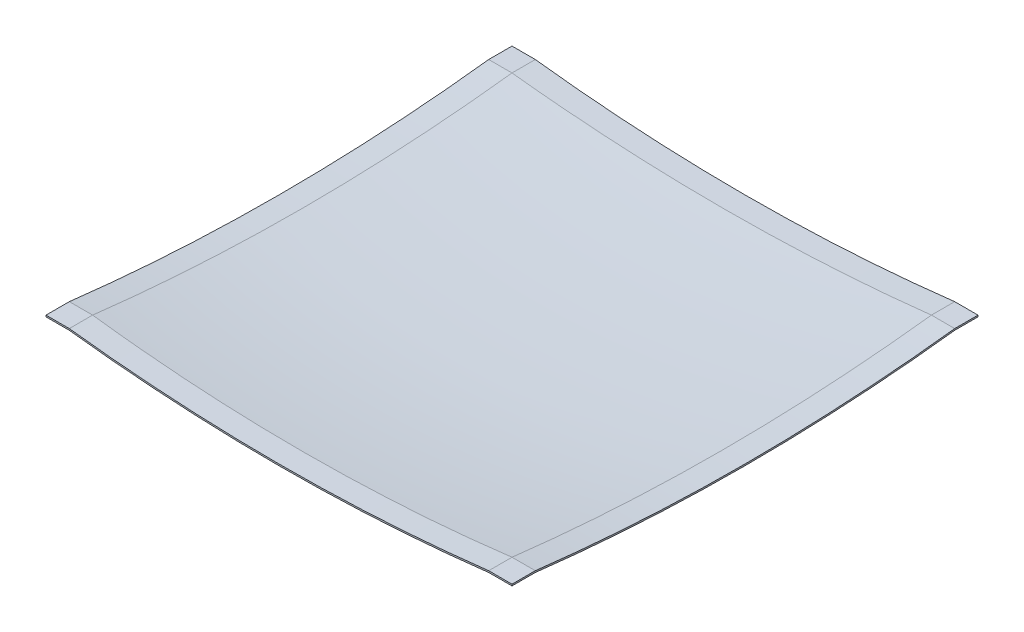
ISO-10303-21;
HEADER;
FILE_DESCRIPTION(('STEP AP214'),'2;1');
FILE_NAME('part.step','',(''),(''),'','','');
FILE_SCHEMA(('AUTOMOTIVE_DESIGN { 1 0 10303 214 1 1 1 1 }'));
ENDSEC;
DATA;
#1=APPLICATION_CONTEXT('core data for automotive mechanical design processes');
#2=APPLICATION_PROTOCOL_DEFINITION('international standard','automotive_design',2000,#1);
#3=PRODUCT_CONTEXT('',#1,'mechanical');
#4=PRODUCT('Part','Part','',(#3));
#5=PRODUCT_RELATED_PRODUCT_CATEGORY('part','',(#4));
#6=PRODUCT_DEFINITION_FORMATION('','',#4);
#7=PRODUCT_DEFINITION_CONTEXT('part definition',#1,'design');
#8=PRODUCT_DEFINITION('design','',#6,#7);
#9=PRODUCT_DEFINITION_SHAPE('','',#8);
#10=(LENGTH_UNIT() NAMED_UNIT(*) SI_UNIT(.MILLI.,.METRE.));
#11=(NAMED_UNIT(*) PLANE_ANGLE_UNIT() SI_UNIT($,.RADIAN.));
#12=(NAMED_UNIT(*) SI_UNIT($,.STERADIAN.) SOLID_ANGLE_UNIT());
#13=UNCERTAINTY_MEASURE_WITH_UNIT(LENGTH_MEASURE(1.E-05),#10,'distance_accuracy_value','');
#14=(GEOMETRIC_REPRESENTATION_CONTEXT(3) GLOBAL_UNCERTAINTY_ASSIGNED_CONTEXT((#13)) GLOBAL_UNIT_ASSIGNED_CONTEXT((#10,
#11,#12)) REPRESENTATION_CONTEXT('',''));
#15=CARTESIAN_POINT('',(0.,0.,0.));
#16=DIRECTION('',(0.,0.,1.));
#17=DIRECTION('',(1.,0.,0.));
#18=AXIS2_PLACEMENT_3D('',#15,#16,#17);
#19=CARTESIAN_POINT('',(150.,0.,-150.));
#20=DIRECTION('',(0.,0.,1.));
#21=DIRECTION('',(-1.,0.,0.));
#22=AXIS2_PLACEMENT_3D('',#19,#20,#21);
#23=PLANE('',#22);
#24=DIRECTION('',(1.,0.,0.));
#25=VECTOR('',#24,1.);
#26=CARTESIAN_POINT('',(150.,-1.,-150.));
#27=LINE('',#26,#25);
#28=CARTESIAN_POINT('',(150.,-1.,-150.));
#29=VERTEX_POINT('',#28);
#30=CARTESIAN_POINT('',(135.059246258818,-0.999999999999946,-150.));
#31=VERTEX_POINT('',#30);
#32=EDGE_CURVE('E152',#29,#31,#27,.F.);
#33=ORIENTED_EDGE('',*,*,#32,.T.);
#34=CARTESIAN_POINT('',(0.,1135.0625,-150.000000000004));
#35=DIRECTION('',(0.,0.,-1.));
#36=DIRECTION('',(0.,1.,0.));
#37=AXIS2_PLACEMENT_3D('',#34,#35,#36);
#38=CIRCLE('',#37,1144.0625);
#39=CARTESIAN_POINT('',(-135.059246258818,-0.999999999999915,-150.));
#40=VERTEX_POINT('',#39);
#41=EDGE_CURVE('E184',#31,#40,#38,.T.);
#42=ORIENTED_EDGE('',*,*,#41,.T.);
#43=DIRECTION('',(1.,0.,0.));
#44=VECTOR('',#43,1.);
#45=CARTESIAN_POINT('',(-150.,-1.,-150.));
#46=LINE('',#45,#44);
#47=CARTESIAN_POINT('',(-150.,-1.,-150.));
#48=VERTEX_POINT('',#47);
#49=EDGE_CURVE('E124',#40,#48,#46,.F.);
#50=ORIENTED_EDGE('',*,*,#49,.T.);
#51=DIRECTION('',(0.,-1.,0.));
#52=VECTOR('',#51,1.);
#53=CARTESIAN_POINT('',(-150.,0.,-150.));
#54=LINE('',#53,#52);
#55=CARTESIAN_POINT('',(-150.,0.,-150.));
#56=VERTEX_POINT('',#55);
#57=EDGE_CURVE('E11',#56,#48,#54,.T.);
#58=ORIENTED_EDGE('',*,*,#57,.F.);
#59=DIRECTION('',(-1.,0.,0.));
#60=VECTOR('',#59,1.);
#61=CARTESIAN_POINT('',(-150.,0.,-150.));
#62=LINE('',#61,#60);
#63=CARTESIAN_POINT('',(-135.,0.,-150.));
#64=VERTEX_POINT('',#63);
#65=EDGE_CURVE('E120',#64,#56,#62,.T.);
#66=ORIENTED_EDGE('',*,*,#65,.F.);
#67=CARTESIAN_POINT('',(0.,1135.0625,-150.));
#68=DIRECTION('',(0.,0.,-1.));
#69=DIRECTION('',(1.,0.,0.));
#70=AXIS2_PLACEMENT_3D('',#67,#68,#69);
#71=CIRCLE('',#70,1143.0625);
#72=CARTESIAN_POINT('',(135.,0.,-150.));
#73=VERTEX_POINT('',#72);
#74=EDGE_CURVE('E259',#73,#64,#71,.T.);
#75=ORIENTED_EDGE('',*,*,#74,.F.);
#76=DIRECTION('',(-1.,0.,0.));
#77=VECTOR('',#76,1.);
#78=CARTESIAN_POINT('',(150.,0.,-150.));
#79=LINE('',#78,#77);
#80=CARTESIAN_POINT('',(150.,0.,-150.));
#81=VERTEX_POINT('',#80);
#82=EDGE_CURVE('E155',#81,#73,#79,.T.);
#83=ORIENTED_EDGE('',*,*,#82,.F.);
#84=DIRECTION('',(0.,-1.,0.));
#85=VECTOR('',#84,1.);
#86=CARTESIAN_POINT('',(150.,0.,-150.));
#87=LINE('',#86,#85);
#88=EDGE_CURVE('E48',#81,#29,#87,.T.);
#89=ORIENTED_EDGE('',*,*,#88,.T.);
#90=EDGE_LOOP('',(#33,#42,#50,#58,#66,#75,#83,#89));
#91=FACE_BOUND('',#90,.T.);
#92=ADVANCED_FACE('F39',(#91),#23,.F.);
#93=CARTESIAN_POINT('',(150.,-4.44089209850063E-13,150.));
#94=DIRECTION('',(-1.,0.,0.));
#95=DIRECTION('',(0.,0.,-1.));
#96=AXIS2_PLACEMENT_3D('',#93,#94,#95);
#97=PLANE('',#96);
#98=DIRECTION('',(0.,0.,1.));
#99=VECTOR('',#98,1.);
#100=CARTESIAN_POINT('',(150.,-1.00000000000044,150.));
#101=LINE('',#100,#99);
#102=CARTESIAN_POINT('',(150.,-1.00000000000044,150.));
#103=VERTEX_POINT('',#102);
#104=CARTESIAN_POINT('',(150.,-1.00000000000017,135.059246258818));
#105=VERTEX_POINT('',#104);
#106=EDGE_CURVE('E284',#103,#105,#101,.F.);
#107=ORIENTED_EDGE('',*,*,#106,.T.);
#108=CARTESIAN_POINT('',(150.,1135.0625,0.));
#109=DIRECTION('',(1.,0.,0.));
#110=DIRECTION('',(0.,0.,-1.));
#111=AXIS2_PLACEMENT_3D('',#108,#109,#110);
#112=CIRCLE('',#111,1144.0625);
#113=CARTESIAN_POINT('',(150.,-0.999999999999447,-135.059246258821));
#114=VERTEX_POINT('',#113);
#115=EDGE_CURVE('E174',#105,#114,#112,.T.);
#116=ORIENTED_EDGE('',*,*,#115,.T.);
#117=DIRECTION('',(0.,0.,-1.));
#118=VECTOR('',#117,1.);
#119=CARTESIAN_POINT('',(150.,-0.99999999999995,-135.));
#120=LINE('',#119,#118);
#121=EDGE_CURVE('E166',#114,#29,#120,.T.);
#122=ORIENTED_EDGE('',*,*,#121,.T.);
#123=ORIENTED_EDGE('',*,*,#88,.F.);
#124=DIRECTION('',(0.,0.,-1.));
#125=VECTOR('',#124,1.);
#126=CARTESIAN_POINT('',(150.,0.,-135.));
#127=LINE('',#126,#125);
#128=CARTESIAN_POINT('',(150.,0.,-135.));
#129=VERTEX_POINT('',#128);
#130=EDGE_CURVE('E257',#129,#81,#127,.T.);
#131=ORIENTED_EDGE('',*,*,#130,.F.);
#132=CARTESIAN_POINT('',(150.,1135.0625,0.));
#133=DIRECTION('',(1.,0.,0.));
#134=DIRECTION('',(0.,-0.993001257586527,0.11810377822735));
#135=AXIS2_PLACEMENT_3D('',#132,#133,#134);
#136=CIRCLE('',#135,1143.0625);
#137=CARTESIAN_POINT('',(150.,-2.22044604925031E-13,135.));
#138=VERTEX_POINT('',#137);
#139=EDGE_CURVE('E135',#138,#129,#136,.T.);
#140=ORIENTED_EDGE('',*,*,#139,.F.);
#141=DIRECTION('',(0.,0.,-1.));
#142=VECTOR('',#141,1.);
#143=CARTESIAN_POINT('',(150.,-4.44089209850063E-13,150.));
#144=LINE('',#143,#142);
#145=CARTESIAN_POINT('',(150.,-4.44089209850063E-13,150.));
#146=VERTEX_POINT('',#145);
#147=EDGE_CURVE('E202',#146,#138,#144,.T.);
#148=ORIENTED_EDGE('',*,*,#147,.F.);
#149=DIRECTION('',(0.,-1.,0.));
#150=VECTOR('',#149,1.);
#151=CARTESIAN_POINT('',(150.,-4.44089209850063E-13,150.));
#152=LINE('',#151,#150);
#153=EDGE_CURVE('E145',#146,#103,#152,.T.);
#154=ORIENTED_EDGE('',*,*,#153,.T.);
#155=EDGE_LOOP('',(#107,#116,#122,#123,#131,#140,#148,#154));
#156=FACE_BOUND('',#155,.T.);
#157=ADVANCED_FACE('F172',(#156),#97,.F.);
#158=CARTESIAN_POINT('',(-150.,-4.44089209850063E-13,150.));
#159=DIRECTION('',(0.,0.,1.));
#160=DIRECTION('',(-1.,0.,0.));
#161=AXIS2_PLACEMENT_3D('',#158,#159,#160);
#162=PLANE('',#161);
#163=DIRECTION('',(1.,0.,0.));
#164=VECTOR('',#163,1.);
#165=CARTESIAN_POINT('',(-150.,-1.00000000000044,150.));
#166=LINE('',#165,#164);
#167=CARTESIAN_POINT('',(-135.059246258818,-1.00000000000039,150.));
#168=VERTEX_POINT('',#167);
#169=CARTESIAN_POINT('',(-150.,-1.00000000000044,150.));
#170=VERTEX_POINT('',#169);
#171=EDGE_CURVE('E293',#168,#170,#166,.F.);
#172=ORIENTED_EDGE('',*,*,#171,.F.);
#173=CARTESIAN_POINT('',(0.,1135.0625,150.));
#174=DIRECTION('',(0.,0.,-1.));
#175=DIRECTION('',(-1.,0.,0.));
#176=AXIS2_PLACEMENT_3D('',#173,#174,#175);
#177=CIRCLE('',#176,1144.0625);
#178=CARTESIAN_POINT('',(135.059246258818,-1.00000000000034,150.));
#179=VERTEX_POINT('',#178);
#180=EDGE_CURVE('E297',#179,#168,#177,.T.);
#181=ORIENTED_EDGE('',*,*,#180,.F.);
#182=DIRECTION('',(1.,0.,0.));
#183=VECTOR('',#182,1.);
#184=CARTESIAN_POINT('',(150.,-1.00000000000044,150.));
#185=LINE('',#184,#183);
#186=EDGE_CURVE('E281',#103,#179,#185,.F.);
#187=ORIENTED_EDGE('',*,*,#186,.F.);
#188=ORIENTED_EDGE('',*,*,#153,.F.);
#189=DIRECTION('',(-1.,0.,0.));
#190=VECTOR('',#189,1.);
#191=CARTESIAN_POINT('',(150.,-4.44089209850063E-13,150.));
#192=LINE('',#191,#190);
#193=CARTESIAN_POINT('',(135.,-4.44089209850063E-13,150.));
#194=VERTEX_POINT('',#193);
#195=EDGE_CURVE('E193',#146,#194,#192,.T.);
#196=ORIENTED_EDGE('',*,*,#195,.T.);
#197=CARTESIAN_POINT('',(0.,1135.0625,150.));
#198=DIRECTION('',(0.,0.,-1.));
#199=DIRECTION('',(1.,0.,0.));
#200=AXIS2_PLACEMENT_3D('',#197,#198,#199);
#201=CIRCLE('',#200,1143.0625);
#202=CARTESIAN_POINT('',(-135.,-4.44089209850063E-13,150.));
#203=VERTEX_POINT('',#202);
#204=EDGE_CURVE('E196',#194,#203,#201,.T.);
#205=ORIENTED_EDGE('',*,*,#204,.T.);
#206=DIRECTION('',(-1.,0.,0.));
#207=VECTOR('',#206,1.);
#208=CARTESIAN_POINT('',(-150.,-4.44089209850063E-13,150.));
#209=LINE('',#208,#207);
#210=CARTESIAN_POINT('',(-150.,-4.44089209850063E-13,150.));
#211=VERTEX_POINT('',#210);
#212=EDGE_CURVE('E208',#203,#211,#209,.T.);
#213=ORIENTED_EDGE('',*,*,#212,.T.);
#214=DIRECTION('',(0.,-1.,0.));
#215=VECTOR('',#214,1.);
#216=CARTESIAN_POINT('',(-150.,-4.44089209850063E-13,150.));
#217=LINE('',#216,#215);
#218=EDGE_CURVE('E142',#211,#170,#217,.T.);
#219=ORIENTED_EDGE('',*,*,#218,.T.);
#220=EDGE_LOOP('',(#172,#181,#187,#188,#196,#205,#213,#219));
#221=FACE_BOUND('',#220,.T.);
#222=ADVANCED_FACE('F276',(#221),#162,.T.);
#223=CARTESIAN_POINT('',(-150.,1135.0625,0.));
#224=DIRECTION('',(-1.,0.,0.));
#225=DIRECTION('',(0.,0.,1.));
#226=AXIS2_PLACEMENT_3D('',#223,#224,#225);
#227=PLANE('',#226);
#228=CARTESIAN_POINT('',(-150.,1135.0625,0.));
#229=DIRECTION('',(1.,0.,0.));
#230=DIRECTION('',(0.,-0.993001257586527,0.11810377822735));
#231=AXIS2_PLACEMENT_3D('',#228,#229,#230);
#232=CIRCLE('',#231,1143.0625);
#233=CARTESIAN_POINT('',(-150.,-2.22044604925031E-13,135.));
#234=VERTEX_POINT('',#233);
#235=CARTESIAN_POINT('',(-150.,0.,-135.));
#236=VERTEX_POINT('',#235);
#237=EDGE_CURVE('E134',#234,#236,#232,.T.);
#238=ORIENTED_EDGE('',*,*,#237,.T.);
#239=DIRECTION('',(0.,0.,-1.));
#240=VECTOR('',#239,1.);
#241=CARTESIAN_POINT('',(-150.,0.,-135.));
#242=LINE('',#241,#240);
#243=EDGE_CURVE('E129',#236,#56,#242,.T.);
#244=ORIENTED_EDGE('',*,*,#243,.T.);
#245=ORIENTED_EDGE('',*,*,#57,.T.);
#246=DIRECTION('',(0.,0.,-1.));
#247=VECTOR('',#246,1.);
#248=CARTESIAN_POINT('',(-150.,-0.99999999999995,-135.));
#249=LINE('',#248,#247);
#250=CARTESIAN_POINT('',(-150.,-0.999999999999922,-135.059246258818));
#251=VERTEX_POINT('',#250);
#252=EDGE_CURVE('E188',#251,#48,#249,.T.);
#253=ORIENTED_EDGE('',*,*,#252,.F.);
#254=CARTESIAN_POINT('',(-150.,1135.0625,0.));
#255=DIRECTION('',(1.,0.,0.));
#256=DIRECTION('',(0.,0.,-1.));
#257=AXIS2_PLACEMENT_3D('',#254,#255,#256);
#258=CIRCLE('',#257,1144.0625);
#259=CARTESIAN_POINT('',(-150.,-1.00000000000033,135.059246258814));
#260=VERTEX_POINT('',#259);
#261=EDGE_CURVE('E56',#260,#251,#258,.T.);
#262=ORIENTED_EDGE('',*,*,#261,.F.);
#263=DIRECTION('',(0.,0.,-1.));
#264=VECTOR('',#263,1.);
#265=CARTESIAN_POINT('',(-150.,-1.00000000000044,150.));
#266=LINE('',#265,#264);
#267=EDGE_CURVE('E303',#170,#260,#266,.T.);
#268=ORIENTED_EDGE('',*,*,#267,.F.);
#269=ORIENTED_EDGE('',*,*,#218,.F.);
#270=DIRECTION('',(0.,0.,-1.));
#271=VECTOR('',#270,1.);
#272=CARTESIAN_POINT('',(-150.,-4.44089209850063E-13,150.));
#273=LINE('',#272,#271);
#274=EDGE_CURVE('E179',#211,#234,#273,.T.);
#275=ORIENTED_EDGE('',*,*,#274,.T.);
#276=EDGE_LOOP('',(#238,#244,#245,#253,#262,#268,#269,#275));
#277=FACE_BOUND('',#276,.T.);
#278=ADVANCED_FACE('F41',(#277),#227,.T.);
#279=CARTESIAN_POINT('',(-150.,-1.00000000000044,150.));
#280=DIRECTION('',(0.,-1.,0.));
#281=DIRECTION('',(0.,0.,-1.));
#282=AXIS2_PLACEMENT_3D('',#279,#280,#281);
#283=PLANE('',#282);
#284=ORIENTED_EDGE('',*,*,#267,.T.);
#285=DIRECTION('',(1.,0.,0.));
#286=VECTOR('',#285,1.);
#287=CARTESIAN_POINT('',(0.,-1.00000000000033,135.059246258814));
#288=LINE('',#287,#286);
#289=CARTESIAN_POINT('',(-135.059246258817,-1.00000000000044,135.059246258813));
#290=VERTEX_POINT('',#289);
#291=EDGE_CURVE('E305',#290,#260,#288,.F.);
#292=ORIENTED_EDGE('',*,*,#291,.F.);
#293=DIRECTION('',(0.,0.,-1.));
#294=VECTOR('',#293,1.);
#295=CARTESIAN_POINT('',(-135.059246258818,-1.00000000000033,150.));
#296=LINE('',#295,#294);
#297=EDGE_CURVE('E528',#168,#290,#296,.T.);
#298=ORIENTED_EDGE('',*,*,#297,.F.);
#299=ORIENTED_EDGE('',*,*,#171,.T.);
#300=EDGE_LOOP('',(#284,#292,#298,#299));
#301=FACE_BOUND('',#300,.T.);
#302=ADVANCED_FACE('F336',(#301),#283,.T.);
#303=CARTESIAN_POINT('',(0.,1135.0625,150.));
#304=DIRECTION('',(0.,0.,-1.));
#305=DIRECTION('',(-1.,0.,0.));
#306=AXIS2_PLACEMENT_3D('',#303,#304,#305);
#307=CYLINDRICAL_SURFACE('',#306,1144.0625);
#308=CARTESIAN_POINT('',(378.117680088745,55.2912168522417,131.682726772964));
#309=CARTESIAN_POINT('',(370.43482497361,52.6007953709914,131.846174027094));
#310=CARTESIAN_POINT('',(362.723146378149,49.9923641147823,132.004338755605));
#311=CARTESIAN_POINT('',(347.245729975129,44.9406420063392,132.310140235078));
#312=CARTESIAN_POINT('',(339.479992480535,42.4973501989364,132.457777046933));
#313=CARTESIAN_POINT('',(323.897926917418,37.7770266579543,132.742562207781));
#314=CARTESIAN_POINT('',(316.081598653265,35.499995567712,132.879710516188));
#315=CARTESIAN_POINT('',(300.401911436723,31.1132396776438,133.143552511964));
#316=CARTESIAN_POINT('',(292.538552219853,29.0035158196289,133.270246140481));
#317=CARTESIAN_POINT('',(276.76897693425,24.9525030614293,133.513200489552));
#318=CARTESIAN_POINT('',(268.862763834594,23.0112026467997,133.629461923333));
#319=CARTESIAN_POINT('',(253.010708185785,19.2978052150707,133.851587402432));
#320=CARTESIAN_POINT('',(245.064866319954,17.5257052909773,133.957451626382));
#321=CARTESIAN_POINT('',(229.137253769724,14.151536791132,134.158807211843));
#322=CARTESIAN_POINT('',(221.155484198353,12.5494629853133,134.254298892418));
#323=CARTESIAN_POINT('',(205.159068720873,9.5159475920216,134.434939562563));
#324=CARTESIAN_POINT('',(197.144420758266,8.08451685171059,134.520087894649));
#325=CARTESIAN_POINT('',(173.501408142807,4.12179533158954,134.755614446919));
#326=CARTESIAN_POINT('',(157.832314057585,1.82879062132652,134.891634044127));
#327=CARTESIAN_POINT('',(126.412188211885,-2.10487381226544,135.12472594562));
#328=CARTESIAN_POINT('',(110.66115664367,-3.74553506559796,135.221798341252));
#329=CARTESIAN_POINT('',(86.9945600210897,-5.71514351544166,135.338256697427));
#330=CARTESIAN_POINT('',(79.0988381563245,-6.28978996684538,135.372218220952));
#331=CARTESIAN_POINT('',(63.2975181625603,-7.27505178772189,135.430431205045));
#332=CARTESIAN_POINT('',(55.3919206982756,-7.68567765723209,135.454683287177));
#333=CARTESIAN_POINT('',(39.5737353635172,-8.34275984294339,135.493485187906));
#334=CARTESIAN_POINT('',(31.6611473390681,-8.58921244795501,135.508034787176));
#335=CARTESIAN_POINT('',(15.8323729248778,-8.91783426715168,135.527434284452));
#336=CARTESIAN_POINT('',(7.91618646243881,-9.00000000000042,135.532283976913));
#337=CARTESIAN_POINT('',(-7.91618646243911,-9.00000000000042,135.532283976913));
#338=CARTESIAN_POINT('',(-15.8323729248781,-8.91783426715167,135.527434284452));
#339=CARTESIAN_POINT('',(-31.6611473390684,-8.589212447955,135.508034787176));
#340=CARTESIAN_POINT('',(-39.5737353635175,-8.34275984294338,135.493485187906));
#341=CARTESIAN_POINT('',(-55.3919206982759,-7.68567765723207,135.454683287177));
#342=CARTESIAN_POINT('',(-63.2975181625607,-7.27505178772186,135.430431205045));
#343=CARTESIAN_POINT('',(-79.0988381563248,-6.28978996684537,135.372218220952));
#344=CARTESIAN_POINT('',(-86.9945600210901,-5.71514351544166,135.338256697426));
#345=CARTESIAN_POINT('',(-110.661156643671,-3.74553506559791,135.221798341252));
#346=CARTESIAN_POINT('',(-126.412188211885,-2.10487381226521,135.124725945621));
#347=CARTESIAN_POINT('',(-157.832314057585,1.82879062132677,134.891634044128));
#348=CARTESIAN_POINT('',(-173.501408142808,4.12179533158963,134.755614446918));
#349=CARTESIAN_POINT('',(-197.144420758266,8.08451685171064,134.52008789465));
#350=CARTESIAN_POINT('',(-205.159068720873,9.51594759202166,134.434939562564));
#351=CARTESIAN_POINT('',(-221.155484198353,12.5494629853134,134.254298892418));
#352=CARTESIAN_POINT('',(-229.137253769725,14.1515367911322,134.15880721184));
#353=CARTESIAN_POINT('',(-245.064866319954,17.5257052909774,133.957451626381));
#354=CARTESIAN_POINT('',(-253.010708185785,19.2978052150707,133.851587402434));
#355=CARTESIAN_POINT('',(-268.862763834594,23.0112026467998,133.629461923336));
#356=CARTESIAN_POINT('',(-276.768976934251,24.9525030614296,133.513200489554));
#357=CARTESIAN_POINT('',(-292.538552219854,29.0035158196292,133.270246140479));
#358=CARTESIAN_POINT('',(-300.401911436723,31.1132396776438,133.143552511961));
#359=CARTESIAN_POINT('',(-316.081598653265,35.4999955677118,132.879710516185));
#360=CARTESIAN_POINT('',(-323.897926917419,37.7770266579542,132.742562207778));
#361=CARTESIAN_POINT('',(-339.479992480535,42.4973501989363,132.457777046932));
#362=CARTESIAN_POINT('',(-347.24572997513,44.9406420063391,132.310140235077));
#363=CARTESIAN_POINT('',(-362.723146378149,49.9923641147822,132.004338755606));
#364=CARTESIAN_POINT('',(-370.43482497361,52.6007953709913,131.846174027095));
#365=CARTESIAN_POINT('',(-378.117680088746,55.2912168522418,131.682726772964));
#366=B_SPLINE_CURVE_WITH_KNOTS('',3,(#308,#309,#310,#311,#312,#313,#314,#315,#316,#317,#318,
#319,#320,#321,#322,#323,#324,#325,#326,#327,#328,#329,#330,#331,#332,#333,#334,#335,#336,#337,
#338,#339,#340,#341,#342,#343,#344,#345,#346,#347,#348,#349,#350,#351,#352,#353,#354,#355,#356,
#357,#358,#359,#360,#361,#362,#363,#364,#365),.UNSPECIFIED.,.F.,.F.,(4,2,2,2,2,2,2,2,2,2,2,2,2,
2,2,2,2,2,2,2,2,2,2,2,2,2,2,2,4),(0.,24.4253831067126,48.8506249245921,73.2759612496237,
97.7014350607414,122.125237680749,146.548620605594,170.97125204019,195.395435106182,
242.890585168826,290.385623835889,314.13423193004,337.88131947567,361.62894381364,
385.377071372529,409.125198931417,432.872823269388,456.619910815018,480.368518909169,
527.863557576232,575.358707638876,599.782890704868,624.205522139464,648.628905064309,
673.052707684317,697.478181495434,721.903517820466,746.328759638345,770.754142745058),.UNSPECIFIED.);
#367=CARTESIAN_POINT('',(135.059246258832,-0.999999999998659,135.059246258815));
#368=VERTEX_POINT('',#367);
#369=EDGE_CURVE('E146',#368,#290,#366,.T.);
#370=ORIENTED_EDGE('',*,*,#369,.F.);
#371=DIRECTION('',(0.,0.,-1.));
#372=VECTOR('',#371,1.);
#373=CARTESIAN_POINT('',(135.059246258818,-1.00000000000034,150.));
#374=LINE('',#373,#372);
#375=EDGE_CURVE('E294',#179,#368,#374,.T.);
#376=ORIENTED_EDGE('',*,*,#375,.F.);
#377=ORIENTED_EDGE('',*,*,#180,.T.);
#378=ORIENTED_EDGE('',*,*,#297,.T.);
#379=EDGE_LOOP('',(#370,#376,#377,#378));
#380=FACE_BOUND('',#379,.T.);
#381=ADVANCED_FACE('F339',(#380),#307,.T.);
#382=CARTESIAN_POINT('',(150.,-1.00000000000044,150.));
#383=DIRECTION('',(0.,-1.,0.));
#384=DIRECTION('',(1.,0.,0.));
#385=AXIS2_PLACEMENT_3D('',#382,#383,#384);
#386=PLANE('',#385);
#387=ORIENTED_EDGE('',*,*,#375,.T.);
#388=DIRECTION('',(1.,0.,0.));
#389=VECTOR('',#388,1.);
#390=CARTESIAN_POINT('',(-3.75644332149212E-12,-0.99999999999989,135.059246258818));
#391=LINE('',#390,#389);
#392=EDGE_CURVE('E292',#105,#368,#391,.F.);
#393=ORIENTED_EDGE('',*,*,#392,.F.);
#394=ORIENTED_EDGE('',*,*,#106,.F.);
#395=ORIENTED_EDGE('',*,*,#186,.T.);
#396=EDGE_LOOP('',(#387,#393,#394,#395));
#397=FACE_BOUND('',#396,.T.);
#398=ADVANCED_FACE('F290',(#397),#386,.T.);
#399=CARTESIAN_POINT('',(0.,1135.0625,0.));
#400=DIRECTION('',(1.,0.,0.));
#401=DIRECTION('',(0.,0.,-1.));
#402=AXIS2_PLACEMENT_3D('',#399,#400,#401);
#403=CYLINDRICAL_SURFACE('',#402,1144.0625);
#404=ORIENTED_EDGE('',*,*,#261,.T.);
#405=DIRECTION('',(1.,0.,0.));
#406=VECTOR('',#405,1.);
#407=CARTESIAN_POINT('',(0.,-0.999999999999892,-135.059246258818));
#408=LINE('',#407,#406);
#409=CARTESIAN_POINT('',(-135.059246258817,-1.,-135.059246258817));
#410=VERTEX_POINT('',#409);
#411=EDGE_CURVE('E192',#410,#251,#408,.F.);
#412=ORIENTED_EDGE('',*,*,#411,.F.);
#413=CARTESIAN_POINT('',(-135.059246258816,1135.0625,0.));
#414=DIRECTION('',(1.,0.,0.));
#415=DIRECTION('',(0.,0.,-1.));
#416=AXIS2_PLACEMENT_3D('',#413,#414,#415);
#417=CIRCLE('',#416,1144.0625);
#418=EDGE_CURVE('E314',#290,#410,#417,.T.);
#419=ORIENTED_EDGE('',*,*,#418,.F.);
#420=ORIENTED_EDGE('',*,*,#291,.T.);
#421=EDGE_LOOP('',(#404,#412,#419,#420));
#422=FACE_BOUND('',#421,.T.);
#423=ADVANCED_FACE('F343',(#422),#403,.T.);
#424=CARTESIAN_POINT('',(0.,1135.0625,0.));
#425=DIRECTION('',(1.,0.,0.));
#426=DIRECTION('',(0.,0.,-1.));
#427=AXIS2_PLACEMENT_3D('',#424,#425,#426);
#428=DEGENERATE_TOROIDAL_SURFACE('',#427,7.9999999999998,1144.0625,.T.);
#429=CARTESIAN_POINT('',(378.117680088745,55.2912168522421,-131.682726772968));
#430=CARTESIAN_POINT('',(370.43482497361,52.6007953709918,-131.8461740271));
#431=CARTESIAN_POINT('',(362.723146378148,49.9923641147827,-132.004338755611));
#432=CARTESIAN_POINT('',(347.245729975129,44.9406420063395,-132.310140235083));
#433=CARTESIAN_POINT('',(339.479992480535,42.4973501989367,-132.457777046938));
#434=CARTESIAN_POINT('',(323.897926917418,37.7770266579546,-132.742562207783));
#435=CARTESIAN_POINT('',(316.081598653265,35.4999955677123,-132.87971051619));
#436=CARTESIAN_POINT('',(300.401911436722,31.1132396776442,-133.143552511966));
#437=CARTESIAN_POINT('',(292.538552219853,29.0035158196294,-133.270246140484));
#438=CARTESIAN_POINT('',(276.76897693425,24.9525030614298,-133.513200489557));
#439=CARTESIAN_POINT('',(268.862763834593,23.0112026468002,-133.629461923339));
#440=CARTESIAN_POINT('',(253.010708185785,19.2978052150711,-133.851587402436));
#441=CARTESIAN_POINT('',(245.064866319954,17.5257052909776,-133.957451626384));
#442=CARTESIAN_POINT('',(229.137253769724,14.1515367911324,-134.158807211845));
#443=CARTESIAN_POINT('',(221.155484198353,12.5494629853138,-134.254298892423));
#444=CARTESIAN_POINT('',(205.159068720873,9.51594759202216,-134.434939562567));
#445=CARTESIAN_POINT('',(197.144420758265,8.08451685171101,-134.520087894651));
#446=CARTESIAN_POINT('',(173.501408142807,4.12179533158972,-134.755614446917));
#447=CARTESIAN_POINT('',(157.832314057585,1.82879062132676,-134.891634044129));
#448=CARTESIAN_POINT('',(126.412188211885,-2.10487381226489,-135.124725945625));
#449=CARTESIAN_POINT('',(110.66115664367,-3.74553506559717,-135.221798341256));
#450=CARTESIAN_POINT('',(86.9945600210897,-5.71514351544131,-135.338256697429));
#451=CARTESIAN_POINT('',(79.0988381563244,-6.28978996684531,-135.372218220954));
#452=CARTESIAN_POINT('',(63.2975181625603,-7.27505178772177,-135.430431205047));
#453=CARTESIAN_POINT('',(55.3919206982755,-7.68567765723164,-135.454683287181));
#454=CARTESIAN_POINT('',(39.5737353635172,-8.34275984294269,-135.49348518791));
#455=CARTESIAN_POINT('',(31.6611473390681,-8.5892124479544,-135.508034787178));
#456=CARTESIAN_POINT('',(15.8323729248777,-8.91783426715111,-135.527434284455));
#457=CARTESIAN_POINT('',(7.9161864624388,-8.99999999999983,-135.532283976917));
#458=CARTESIAN_POINT('',(-7.91618646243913,-8.99999999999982,-135.532283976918));
#459=CARTESIAN_POINT('',(-15.8323729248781,-8.91783426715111,-135.527434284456));
#460=CARTESIAN_POINT('',(-31.6611473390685,-8.58921244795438,-135.508034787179));
#461=CARTESIAN_POINT('',(-39.5737353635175,-8.34275984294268,-135.493485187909));
#462=CARTESIAN_POINT('',(-55.3919206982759,-7.68567765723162,-135.454683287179));
#463=CARTESIAN_POINT('',(-63.2975181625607,-7.27505178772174,-135.430431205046));
#464=CARTESIAN_POINT('',(-79.0988381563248,-6.28978996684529,-135.372218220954));
#465=CARTESIAN_POINT('',(-86.9945600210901,-5.7151435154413,-135.33825669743));
#466=CARTESIAN_POINT('',(-110.661156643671,-3.74553506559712,-135.221798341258));
#467=CARTESIAN_POINT('',(-126.412188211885,-2.1048738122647,-135.124725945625));
#468=CARTESIAN_POINT('',(-157.832314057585,1.82879062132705,-134.89163404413));
#469=CARTESIAN_POINT('',(-173.501408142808,4.12179533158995,-134.755614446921));
#470=CARTESIAN_POINT('',(-197.144420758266,8.08451685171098,-134.520087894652));
#471=CARTESIAN_POINT('',(-205.159068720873,9.51594759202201,-134.434939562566));
#472=CARTESIAN_POINT('',(-221.155484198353,12.5494629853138,-134.254298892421));
#473=CARTESIAN_POINT('',(-229.137253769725,14.1515367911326,-134.158807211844));
#474=CARTESIAN_POINT('',(-245.064866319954,17.5257052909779,-133.957451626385));
#475=CARTESIAN_POINT('',(-253.010708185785,19.2978052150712,-133.851587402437));
#476=CARTESIAN_POINT('',(-268.862763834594,23.0112026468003,-133.62946192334));
#477=CARTESIAN_POINT('',(-276.768976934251,24.9525030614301,-133.513200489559));
#478=CARTESIAN_POINT('',(-292.538552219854,29.0035158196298,-133.270246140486));
#479=CARTESIAN_POINT('',(-300.401911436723,31.1132396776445,-133.143552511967));
#480=CARTESIAN_POINT('',(-316.081598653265,35.4999955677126,-132.87971051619));
#481=CARTESIAN_POINT('',(-323.897926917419,37.7770266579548,-132.742562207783));
#482=CARTESIAN_POINT('',(-339.479992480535,42.4973501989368,-132.457777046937));
#483=CARTESIAN_POINT('',(-347.24572997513,44.9406420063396,-132.310140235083));
#484=CARTESIAN_POINT('',(-362.723146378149,49.9923641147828,-132.004338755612));
#485=CARTESIAN_POINT('',(-370.43482497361,52.6007953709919,-131.846174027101));
#486=CARTESIAN_POINT('',(-378.117680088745,55.2912168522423,-131.682726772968));
#487=B_SPLINE_CURVE_WITH_KNOTS('',3,(#429,#430,#431,#432,#433,#434,#435,#436,#437,#438,#439,
#440,#441,#442,#443,#444,#445,#446,#447,#448,#449,#450,#451,#452,#453,#454,#455,#456,#457,#458,
#459,#460,#461,#462,#463,#464,#465,#466,#467,#468,#469,#470,#471,#472,#473,#474,#475,#476,#477,
#478,#479,#480,#481,#482,#483,#484,#485,#486),.UNSPECIFIED.,.F.,.F.,(4,2,2,2,2,2,2,2,2,2,2,2,2,
2,2,2,2,2,2,2,2,2,2,2,2,2,2,2,4),(0.,24.4253831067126,48.850624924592,73.2759612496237,
97.7014350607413,122.125237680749,146.548620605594,170.97125204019,195.395435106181,
242.890585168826,290.385623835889,314.13423193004,337.88131947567,361.62894381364,
385.377071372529,409.125198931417,432.872823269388,456.619910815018,480.368518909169,
527.863557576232,575.358707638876,599.782890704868,624.205522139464,648.628905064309,
673.052707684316,697.478181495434,721.903517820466,746.328759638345,770.754142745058),.UNSPECIFIED.);
#488=CARTESIAN_POINT('',(135.059246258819,-0.999999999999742,-135.059246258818));
#489=VERTEX_POINT('',#488);
#490=EDGE_CURVE('E191',#489,#410,#487,.T.);
#491=ORIENTED_EDGE('',*,*,#490,.F.);
#492=CARTESIAN_POINT('',(135.059246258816,1135.0625,0.));
#493=DIRECTION('',(-1.,0.,0.));
#494=DIRECTION('',(0.,0.,1.));
#495=AXIS2_PLACEMENT_3D('',#492,#493,#494);
#496=CIRCLE('',#495,1144.0625);
#497=EDGE_CURVE('E308',#368,#489,#496,.F.);
#498=ORIENTED_EDGE('',*,*,#497,.F.);
#499=ORIENTED_EDGE('',*,*,#369,.T.);
#500=ORIENTED_EDGE('',*,*,#418,.T.);
#501=EDGE_LOOP('',(#491,#498,#499,#500));
#502=FACE_BOUND('',#501,.T.);
#503=ADVANCED_FACE('F327',(#502),#428,.T.);
#504=CARTESIAN_POINT('',(0.,1135.0625,0.));
#505=DIRECTION('',(1.,0.,0.));
#506=DIRECTION('',(0.,0.,-1.));
#507=AXIS2_PLACEMENT_3D('',#504,#505,#506);
#508=CYLINDRICAL_SURFACE('',#507,1144.0625);
#509=ORIENTED_EDGE('',*,*,#497,.T.);
#510=DIRECTION('',(1.,0.,0.));
#511=VECTOR('',#510,1.);
#512=CARTESIAN_POINT('',(-3.75644332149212E-12,-0.999999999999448,-135.059246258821));
#513=LINE('',#512,#511);
#514=EDGE_CURVE('E306',#114,#489,#513,.F.);
#515=ORIENTED_EDGE('',*,*,#514,.F.);
#516=ORIENTED_EDGE('',*,*,#115,.F.);
#517=ORIENTED_EDGE('',*,*,#392,.T.);
#518=EDGE_LOOP('',(#509,#515,#516,#517));
#519=FACE_BOUND('',#518,.T.);
#520=ADVANCED_FACE('F347',(#519),#508,.T.);
#521=CARTESIAN_POINT('',(-150.,-0.99999999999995,-135.));
#522=DIRECTION('',(0.,-1.,0.));
#523=DIRECTION('',(0.,0.,-1.));
#524=AXIS2_PLACEMENT_3D('',#521,#522,#523);
#525=PLANE('',#524);
#526=ORIENTED_EDGE('',*,*,#252,.T.);
#527=ORIENTED_EDGE('',*,*,#49,.F.);
#528=DIRECTION('',(0.,0.,-1.));
#529=VECTOR('',#528,1.);
#530=CARTESIAN_POINT('',(-135.059246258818,-0.99999999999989,-134.999999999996));
#531=LINE('',#530,#529);
#532=EDGE_CURVE('E186',#410,#40,#531,.T.);
#533=ORIENTED_EDGE('',*,*,#532,.F.);
#534=ORIENTED_EDGE('',*,*,#411,.T.);
#535=EDGE_LOOP('',(#526,#527,#533,#534));
#536=FACE_BOUND('',#535,.T.);
#537=ADVANCED_FACE('F334',(#536),#525,.T.);
#538=CARTESIAN_POINT('',(0.,1135.0625,-135.));
#539=DIRECTION('',(0.,0.,-1.));
#540=DIRECTION('',(0.,1.,0.));
#541=AXIS2_PLACEMENT_3D('',#538,#539,#540);
#542=CYLINDRICAL_SURFACE('',#541,1144.0625);
#543=DIRECTION('',(0.,0.,-1.));
#544=VECTOR('',#543,1.);
#545=CARTESIAN_POINT('',(135.059246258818,-0.999999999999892,-134.999999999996));
#546=LINE('',#545,#544);
#547=EDGE_CURVE('E169',#489,#31,#546,.T.);
#548=ORIENTED_EDGE('',*,*,#547,.F.);
#549=ORIENTED_EDGE('',*,*,#490,.T.);
#550=ORIENTED_EDGE('',*,*,#532,.T.);
#551=ORIENTED_EDGE('',*,*,#41,.F.);
#552=EDGE_LOOP('',(#548,#549,#550,#551));
#553=FACE_BOUND('',#552,.T.);
#554=ADVANCED_FACE('F330',(#553),#542,.T.);
#555=CARTESIAN_POINT('',(150.,-0.99999999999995,-135.));
#556=DIRECTION('',(0.,-1.,0.));
#557=DIRECTION('',(0.,0.,-1.));
#558=AXIS2_PLACEMENT_3D('',#555,#556,#557);
#559=PLANE('',#558);
#560=ORIENTED_EDGE('',*,*,#547,.T.);
#561=ORIENTED_EDGE('',*,*,#32,.F.);
#562=ORIENTED_EDGE('',*,*,#121,.F.);
#563=ORIENTED_EDGE('',*,*,#514,.T.);
#564=EDGE_LOOP('',(#560,#561,#562,#563));
#565=FACE_BOUND('',#564,.T.);
#566=ADVANCED_FACE('F163',(#565),#559,.T.);
#567=CARTESIAN_POINT('',(-150.,-4.44089209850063E-13,150.));
#568=DIRECTION('',(0.,-1.,0.));
#569=DIRECTION('',(0.,0.,-1.));
#570=AXIS2_PLACEMENT_3D('',#567,#568,#569);
#571=PLANE('',#570);
#572=ORIENTED_EDGE('',*,*,#274,.F.);
#573=ORIENTED_EDGE('',*,*,#212,.F.);
#574=DIRECTION('',(0.,0.,-1.));
#575=VECTOR('',#574,1.);
#576=CARTESIAN_POINT('',(-135.,-4.44089209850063E-13,150.));
#577=LINE('',#576,#575);
#578=CARTESIAN_POINT('',(-135.,-2.22044604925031E-13,135.));
#579=VERTEX_POINT('',#578);
#580=EDGE_CURVE('E205',#203,#579,#577,.T.);
#581=ORIENTED_EDGE('',*,*,#580,.T.);
#582=DIRECTION('',(-1.,0.,0.));
#583=VECTOR('',#582,1.);
#584=CARTESIAN_POINT('',(-150.,-4.44089209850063E-13,135.));
#585=LINE('',#584,#583);
#586=EDGE_CURVE('E213',#579,#234,#585,.T.);
#587=ORIENTED_EDGE('',*,*,#586,.T.);
#588=EDGE_LOOP('',(#572,#573,#581,#587));
#589=FACE_BOUND('',#588,.T.);
#590=ADVANCED_FACE('F356',(#589),#571,.F.);
#591=CARTESIAN_POINT('',(0.,1135.0625,150.));
#592=DIRECTION('',(0.,0.,-1.));
#593=DIRECTION('',(-1.,0.,0.));
#594=AXIS2_PLACEMENT_3D('',#591,#592,#593);
#595=CYLINDRICAL_SURFACE('',#594,1143.0625);
#596=CARTESIAN_POINT('',(135.0002,2.37872536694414E-05,134.99999859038));
#597=CARTESIAN_POINT('',(129.391699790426,-0.667030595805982,135.039527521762));
#598=CARTESIAN_POINT('',(123.778323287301,-1.29250798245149,135.076575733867));
#599=CARTESIAN_POINT('',(112.542885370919,-2.46019364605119,135.145715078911));
#600=CARTESIAN_POINT('',(106.920823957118,-3.0024019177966,135.177806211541));
#601=CARTESIAN_POINT('',(90.0435382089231,-4.50392150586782,135.266648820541));
#602=CARTESIAN_POINT('',(78.7768899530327,-5.33816594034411,135.315971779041));
#603=CARTESIAN_POINT('',(56.263426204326,-6.66996561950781,135.39468595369));
#604=CARTESIAN_POINT('',(45.0166794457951,-7.16868979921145,135.424146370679));
#605=CARTESIAN_POINT('',(22.5132884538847,-7.83370688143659,135.463425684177));
#606=CARTESIAN_POINT('',(11.2566442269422,-8.00000000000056,135.473244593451));
#607=CARTESIAN_POINT('',(-11.2566442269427,-8.00000000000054,135.473244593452));
#608=CARTESIAN_POINT('',(-22.5132884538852,-7.83370688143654,135.463425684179));
#609=CARTESIAN_POINT('',(-45.0166794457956,-7.16868979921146,135.42414637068));
#610=CARTESIAN_POINT('',(-56.2634262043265,-6.66996561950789,135.394685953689));
#611=CARTESIAN_POINT('',(-78.7768899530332,-5.33816594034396,135.315971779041));
#612=CARTESIAN_POINT('',(-90.0435382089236,-4.50392150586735,135.266648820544));
#613=CARTESIAN_POINT('',(-106.920823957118,-3.00240191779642,135.177806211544));
#614=CARTESIAN_POINT('',(-112.542885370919,-2.46019364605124,135.145715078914));
#615=CARTESIAN_POINT('',(-123.778323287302,-1.29250798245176,135.076575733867));
#616=CARTESIAN_POINT('',(-129.391699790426,-0.667030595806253,135.039527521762));
#617=CARTESIAN_POINT('',(-135.0002,2.37872537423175E-05,134.999998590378));
#618=B_SPLINE_CURVE_WITH_KNOTS('',3,(#596,#597,#598,#599,#600,#601,#602,#603,#604,#605,#606,
#607,#608,#609,#610,#611,#612,#613,#614,#615,#616,#617),.UNSPECIFIED.,.F.,.F.,(4,2,2,2,2,2,2,2,
2,2,4),(0.,16.9441763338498,33.8883537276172,67.7757348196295,101.544434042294,135.313111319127,
169.08178859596,202.850487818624,236.737868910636,253.682046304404,270.626222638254),.UNSPECIFIED.);
#619=CARTESIAN_POINT('',(135.,-2.22044604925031E-13,135.));
#620=VERTEX_POINT('',#619);
#621=EDGE_CURVE('E176',#620,#579,#618,.T.);
#622=ORIENTED_EDGE('',*,*,#621,.T.);
#623=ORIENTED_EDGE('',*,*,#580,.F.);
#624=ORIENTED_EDGE('',*,*,#204,.F.);
#625=DIRECTION('',(0.,0.,-1.));
#626=VECTOR('',#625,1.);
#627=CARTESIAN_POINT('',(135.,-4.44089209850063E-13,150.));
#628=LINE('',#627,#626);
#629=EDGE_CURVE('E201',#194,#620,#628,.T.);
#630=ORIENTED_EDGE('',*,*,#629,.T.);
#631=EDGE_LOOP('',(#622,#623,#624,#630));
#632=FACE_BOUND('',#631,.T.);
#633=ADVANCED_FACE('F225',(#632),#595,.F.);
#634=CARTESIAN_POINT('',(150.,-4.44089209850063E-13,150.));
#635=DIRECTION('',(0.,-1.,0.));
#636=DIRECTION('',(1.,0.,0.));
#637=AXIS2_PLACEMENT_3D('',#634,#635,#636);
#638=PLANE('',#637);
#639=ORIENTED_EDGE('',*,*,#629,.F.);
#640=ORIENTED_EDGE('',*,*,#195,.F.);
#641=ORIENTED_EDGE('',*,*,#147,.T.);
#642=DIRECTION('',(-1.,0.,0.));
#643=VECTOR('',#642,1.);
#644=CARTESIAN_POINT('',(150.,-4.44089209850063E-13,135.));
#645=LINE('',#644,#643);
#646=EDGE_CURVE('E198',#138,#620,#645,.T.);
#647=ORIENTED_EDGE('',*,*,#646,.T.);
#648=EDGE_LOOP('',(#639,#640,#641,#647));
#649=FACE_BOUND('',#648,.T.);
#650=ADVANCED_FACE('F238',(#649),#638,.F.);
#651=CARTESIAN_POINT('',(0.,1135.0625,0.));
#652=DIRECTION('',(1.,0.,0.));
#653=DIRECTION('',(0.,0.,-1.));
#654=AXIS2_PLACEMENT_3D('',#651,#652,#653);
#655=CYLINDRICAL_SURFACE('',#654,1143.0625);
#656=ORIENTED_EDGE('',*,*,#237,.F.);
#657=ORIENTED_EDGE('',*,*,#586,.F.);
#658=CARTESIAN_POINT('',(-135.,1135.0625,0.));
#659=DIRECTION('',(1.,0.,0.));
#660=DIRECTION('',(0.,-0.993001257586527,0.11810377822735));
#661=AXIS2_PLACEMENT_3D('',#658,#659,#660);
#662=CIRCLE('',#661,1143.0625);
#663=CARTESIAN_POINT('',(-135.,0.,-135.));
#664=VERTEX_POINT('',#663);
#665=EDGE_CURVE('E560',#579,#664,#662,.T.);
#666=ORIENTED_EDGE('',*,*,#665,.T.);
#667=DIRECTION('',(-1.,0.,0.));
#668=VECTOR('',#667,1.);
#669=CARTESIAN_POINT('',(-150.,0.,-135.));
#670=LINE('',#669,#668);
#671=EDGE_CURVE('E559',#664,#236,#670,.T.);
#672=ORIENTED_EDGE('',*,*,#671,.T.);
#673=EDGE_LOOP('',(#656,#657,#666,#672));
#674=FACE_BOUND('',#673,.T.);
#675=ADVANCED_FACE('F235',(#674),#655,.F.);
#676=CARTESIAN_POINT('',(0.,1135.0625,0.));
#677=DIRECTION('',(1.,0.,0.));
#678=DIRECTION('',(0.,0.,-1.));
#679=AXIS2_PLACEMENT_3D('',#676,#677,#678);
#680=DEGENERATE_TOROIDAL_SURFACE('',#679,7.9999999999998,1143.0625,.T.);
#681=CARTESIAN_POINT('',(135.0002,2.37872541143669E-05,-134.999998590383));
#682=CARTESIAN_POINT('',(129.391699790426,-0.667030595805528,-135.039527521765));
#683=CARTESIAN_POINT('',(123.778323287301,-1.29250798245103,-135.07657573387));
#684=CARTESIAN_POINT('',(112.542885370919,-2.4601936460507,-135.145715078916));
#685=CARTESIAN_POINT('',(106.920823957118,-3.0024019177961,-135.177806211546));
#686=CARTESIAN_POINT('',(90.0435382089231,-4.50392150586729,-135.266648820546));
#687=CARTESIAN_POINT('',(78.7768899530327,-5.33816594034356,-135.315971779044));
#688=CARTESIAN_POINT('',(56.263426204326,-6.66996561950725,-135.394685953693));
#689=CARTESIAN_POINT('',(45.0166794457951,-7.16868979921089,-135.424146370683));
#690=CARTESIAN_POINT('',(22.5132884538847,-7.83370688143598,-135.463425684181));
#691=CARTESIAN_POINT('',(11.2566442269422,-7.9999999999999,-135.473244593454));
#692=CARTESIAN_POINT('',(-11.2566442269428,-8.00000000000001,-135.473244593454));
#693=CARTESIAN_POINT('',(-22.5132884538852,-7.83370688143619,-135.463425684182));
#694=CARTESIAN_POINT('',(-45.0166794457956,-7.16868979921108,-135.424146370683));
#695=CARTESIAN_POINT('',(-56.2634262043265,-6.66996561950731,-135.394685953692));
#696=CARTESIAN_POINT('',(-78.7768899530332,-5.33816594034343,-135.315971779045));
#697=CARTESIAN_POINT('',(-90.0435382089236,-4.50392150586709,-135.266648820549));
#698=CARTESIAN_POINT('',(-106.920823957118,-3.00240191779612,-135.177806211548));
#699=CARTESIAN_POINT('',(-112.542885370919,-2.46019364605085,-135.145715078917));
#700=CARTESIAN_POINT('',(-123.778323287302,-1.29250798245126,-135.07657573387));
#701=CARTESIAN_POINT('',(-129.391699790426,-0.667030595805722,-135.039527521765));
#702=CARTESIAN_POINT('',(-135.0002,2.37872541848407E-05,-134.999998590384));
#703=B_SPLINE_CURVE_WITH_KNOTS('',3,(#681,#682,#683,#684,#685,#686,#687,#688,#689,#690,#691,
#692,#693,#694,#695,#696,#697,#698,#699,#700,#701,#702),.UNSPECIFIED.,.F.,.F.,(4,2,2,2,2,2,2,2,
2,2,4),(0.,16.9441763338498,33.8883537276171,67.7757348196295,101.544434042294,135.313111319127,
169.08178859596,202.850487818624,236.737868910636,253.682046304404,270.626222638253),.UNSPECIFIED.);
#704=CARTESIAN_POINT('',(135.,0.,-135.));
#705=VERTEX_POINT('',#704);
#706=EDGE_CURVE('E197',#705,#664,#703,.T.);
#707=ORIENTED_EDGE('',*,*,#706,.T.);
#708=ORIENTED_EDGE('',*,*,#665,.F.);
#709=ORIENTED_EDGE('',*,*,#621,.F.);
#710=CARTESIAN_POINT('',(135.,1135.0625,0.));
#711=DIRECTION('',(1.,0.,0.));
#712=DIRECTION('',(0.,-0.993001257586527,0.11810377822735));
#713=AXIS2_PLACEMENT_3D('',#710,#711,#712);
#714=CIRCLE('',#713,1143.0625);
#715=EDGE_CURVE('E270',#620,#705,#714,.T.);
#716=ORIENTED_EDGE('',*,*,#715,.T.);
#717=EDGE_LOOP('',(#707,#708,#709,#716));
#718=FACE_BOUND('',#717,.T.);
#719=ADVANCED_FACE('F233',(#718),#680,.F.);
#720=CARTESIAN_POINT('',(0.,1135.0625,0.));
#721=DIRECTION('',(1.,0.,0.));
#722=DIRECTION('',(0.,0.,-1.));
#723=AXIS2_PLACEMENT_3D('',#720,#721,#722);
#724=CYLINDRICAL_SURFACE('',#723,1143.0625);
#725=ORIENTED_EDGE('',*,*,#715,.F.);
#726=ORIENTED_EDGE('',*,*,#646,.F.);
#727=ORIENTED_EDGE('',*,*,#139,.T.);
#728=DIRECTION('',(-1.,0.,0.));
#729=VECTOR('',#728,1.);
#730=CARTESIAN_POINT('',(150.,0.,-135.));
#731=LINE('',#730,#729);
#732=EDGE_CURVE('E138',#129,#705,#731,.T.);
#733=ORIENTED_EDGE('',*,*,#732,.T.);
#734=EDGE_LOOP('',(#725,#726,#727,#733));
#735=FACE_BOUND('',#734,.T.);
#736=ADVANCED_FACE('F230',(#735),#724,.F.);
#737=CARTESIAN_POINT('',(-150.,0.,-135.));
#738=DIRECTION('',(0.,-1.,0.));
#739=DIRECTION('',(0.,0.,-1.));
#740=AXIS2_PLACEMENT_3D('',#737,#738,#739);
#741=PLANE('',#740);
#742=ORIENTED_EDGE('',*,*,#243,.F.);
#743=ORIENTED_EDGE('',*,*,#671,.F.);
#744=DIRECTION('',(0.,0.,-1.));
#745=VECTOR('',#744,1.);
#746=CARTESIAN_POINT('',(-135.,0.,-135.));
#747=LINE('',#746,#745);
#748=EDGE_CURVE('E112',#664,#64,#747,.T.);
#749=ORIENTED_EDGE('',*,*,#748,.T.);
#750=ORIENTED_EDGE('',*,*,#65,.T.);
#751=EDGE_LOOP('',(#742,#743,#749,#750));
#752=FACE_BOUND('',#751,.T.);
#753=ADVANCED_FACE('F128',(#752),#741,.F.);
#754=CARTESIAN_POINT('',(0.,1135.0625,-135.));
#755=DIRECTION('',(0.,0.,-1.));
#756=DIRECTION('',(0.,1.,0.));
#757=AXIS2_PLACEMENT_3D('',#754,#755,#756);
#758=CYLINDRICAL_SURFACE('',#757,1143.0625);
#759=DIRECTION('',(0.,0.,-1.));
#760=VECTOR('',#759,1.);
#761=CARTESIAN_POINT('',(135.,0.,-135.));
#762=LINE('',#761,#760);
#763=EDGE_CURVE('E256',#705,#73,#762,.T.);
#764=ORIENTED_EDGE('',*,*,#763,.T.);
#765=ORIENTED_EDGE('',*,*,#74,.T.);
#766=ORIENTED_EDGE('',*,*,#748,.F.);
#767=ORIENTED_EDGE('',*,*,#706,.F.);
#768=EDGE_LOOP('',(#764,#765,#766,#767));
#769=FACE_BOUND('',#768,.T.);
#770=ADVANCED_FACE('F262',(#769),#758,.F.);
#771=CARTESIAN_POINT('',(150.,0.,-135.));
#772=DIRECTION('',(0.,-1.,0.));
#773=DIRECTION('',(0.,0.,-1.));
#774=AXIS2_PLACEMENT_3D('',#771,#772,#773);
#775=PLANE('',#774);
#776=ORIENTED_EDGE('',*,*,#763,.F.);
#777=ORIENTED_EDGE('',*,*,#732,.F.);
#778=ORIENTED_EDGE('',*,*,#130,.T.);
#779=ORIENTED_EDGE('',*,*,#82,.T.);
#780=EDGE_LOOP('',(#776,#777,#778,#779));
#781=FACE_BOUND('',#780,.T.);
#782=ADVANCED_FACE('F266',(#781),#775,.F.);
#783=CLOSED_SHELL('',(#92,#157,#222,#278,#302,#381,#398,#423,#503,#520,#537,#554,#566,#590,#633,
#650,#675,#719,#736,#753,#770,#782));
#784=MANIFOLD_SOLID_BREP('B2',#783);
#785=ADVANCED_BREP_SHAPE_REPRESENTATION('',(#18,#784),#14);
#786=SHAPE_DEFINITION_REPRESENTATION(#9,#785);
ENDSEC;
END-ISO-10303-21;
